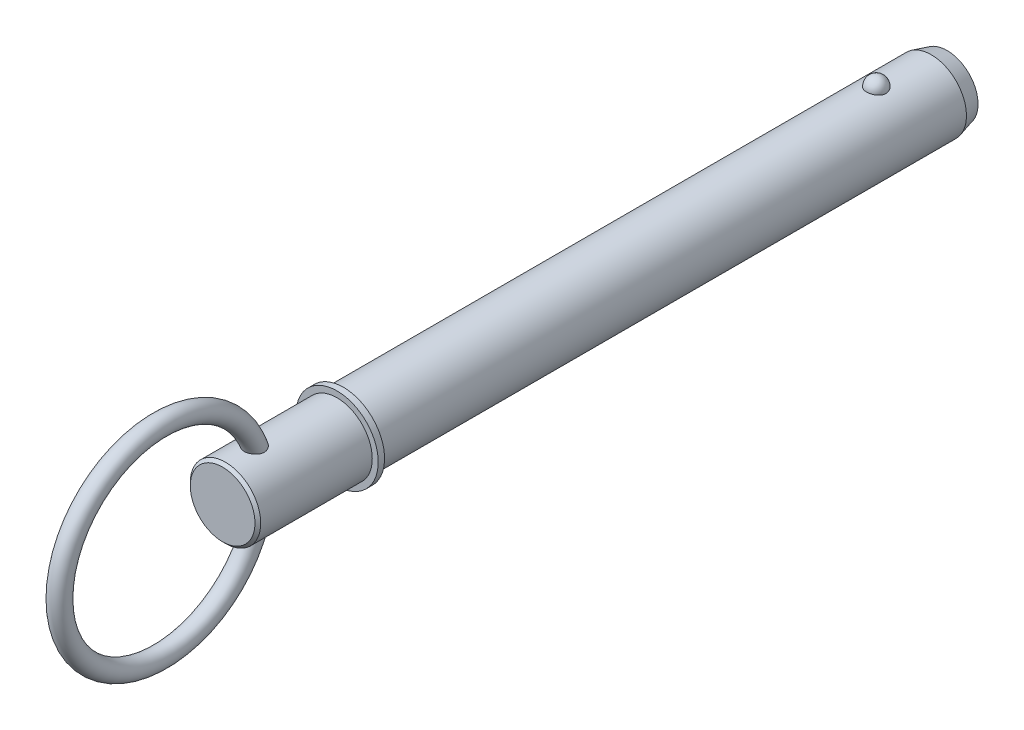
from build123d import *

# Parameters (mm, degrees)
SKETCH2_R           = 11.115
BOSS_EXTRUDE1_DEPTH = 165.1
BOSS_EXTRUDE2_START = 25.4
SKETCH3_R           = 11.115
BOSS_EXTRUDE2_DEPTH = 25.4
CHAMFER1_SIZE       = 5
CHAMFER1_SIZE2      = 1.339745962
SKETCH20_W          = 2
SKETCH20_H          = 13
SKETCH21_R          = 11.115
BOSS_EXTRUDE3_DEPTH = 38.1
CHAMFER2_SIZE       = 0.9
SKETCH24_R          = 3


with BuildPart() as part:
    # Sketch2 → Boss-Extrude1 (new body)
    with BuildSketch(Plane.XY):
        Circle(SKETCH2_R)
    extrude(amount=BOSS_EXTRUDE1_DEPTH)

    # Sketch3 → Boss-Extrude2 (add)
    with BuildSketch(Plane(origin=(0, 0, 0), x_dir=(-1, 0, 0), z_dir=(0, 0, -1)).offset(BOSS_EXTRUDE2_START)):
        Circle(SKETCH3_R)
    extrude(amount=-BOSS_EXTRUDE2_DEPTH)

    # Chamfer1
    chamfer1_edges = [part.edges().sort_by_distance(p)[0] for p in [
        (11.115, 0, -25.4),
    ]]
    chamfer1_side = [part.faces().sort_by_distance(p)[0] for p in [
        (11.115, 0, -12.7),
    ]]
    chamfer(chamfer1_edges, length=CHAMFER1_SIZE, length2=CHAMFER1_SIZE2, reference=chamfer1_side[0])

    # Sketch18 → Revolve1 (revolve)
    with BuildSketch(Plane(origin=(0, 0, 0), x_dir=(0, 0, -1), z_dir=(1, 0, 0))):
        with BuildLine():
            Line((3.07, 14.185), (3.07, 8.045))
            ThreePointArc((3.07, 8.045), (0, 11.115), (3.07, 14.185))
        make_face()
    revolve(axis=Axis((0, 14.185, -3.07), (0, -1, 0)))

    # Sketch20 → Revolve2 (revolve)
    with BuildSketch(Plane(origin=(0, 0, 0), x_dir=(0, 0, -1), z_dir=(1, 0, 0)), mode=Mode.PRIVATE) as revolve2_sk:
        with Locations((-166.1, 6.5)):
            Rectangle(SKETCH20_W, SKETCH20_H)
    revolve(revolve2_sk.sketch.rotate(Axis((0, 0, 33.728787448), (0, 0, 1)), 90), axis=Axis((0, 0, 33.728787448), (0, 0, 1)))

    # Sketch21 → Boss-Extrude3 (add)
    with BuildSketch(Plane(origin=(0, 0, 165.1), x_dir=(-1, 0, 0), z_dir=(0, 0, -1))):
        Circle(SKETCH21_R)
    extrude(amount=-BOSS_EXTRUDE3_DEPTH)

    # Chamfer2
    chamfer2_edges = [part.edges().sort_by_distance(p)[0] for p in [
        (11.115, 0, 203.2),
    ]]
    chamfer(chamfer2_edges, length=CHAMFER2_SIZE)

    # Sweep1: sweep along a path in Sketch23
    with BuildLine(Plane(origin=(0, 0, 0), x_dir=(0, 0, -1), z_dir=(1, 0, 0))) as sweep1_path:
        CenterArc((-222.95, 0), 31.75, 0, 360)
    # Sketch24 → Sweep1 (sweep)
    with BuildSketch(Plane(origin=(0, 0, 0), x_dir=(1, 0, 0), z_dir=(0, 1, 0))):
        with Locations((0, -191.2)):
            Circle(SKETCH24_R)
    sweep(path=sweep1_path.line)


solid = part.part
